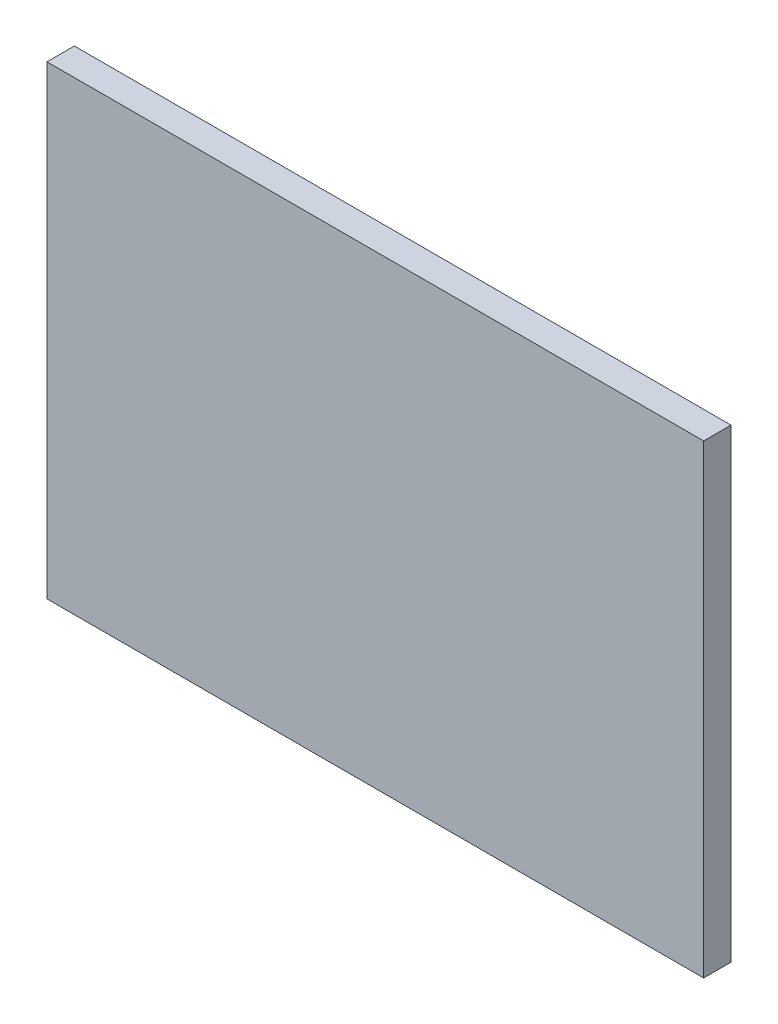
ISO-10303-21;
HEADER;
FILE_DESCRIPTION(('STEP AP214'),'2;1');
FILE_NAME('part.step','',(''),(''),'','','');
FILE_SCHEMA(('AUTOMOTIVE_DESIGN { 1 0 10303 214 1 1 1 1 }'));
ENDSEC;
DATA;
#1=APPLICATION_CONTEXT('core data for automotive mechanical design processes');
#2=APPLICATION_PROTOCOL_DEFINITION('international standard','automotive_design',2000,#1);
#3=PRODUCT_CONTEXT('',#1,'mechanical');
#4=PRODUCT('Part','Part','',(#3));
#5=PRODUCT_RELATED_PRODUCT_CATEGORY('part','',(#4));
#6=PRODUCT_DEFINITION_FORMATION('','',#4);
#7=PRODUCT_DEFINITION_CONTEXT('part definition',#1,'design');
#8=PRODUCT_DEFINITION('design','',#6,#7);
#9=PRODUCT_DEFINITION_SHAPE('','',#8);
#10=(LENGTH_UNIT() NAMED_UNIT(*) SI_UNIT(.MILLI.,.METRE.));
#11=(NAMED_UNIT(*) PLANE_ANGLE_UNIT() SI_UNIT($,.RADIAN.));
#12=(NAMED_UNIT(*) SI_UNIT($,.STERADIAN.) SOLID_ANGLE_UNIT());
#13=UNCERTAINTY_MEASURE_WITH_UNIT(LENGTH_MEASURE(1.E-05),#10,'distance_accuracy_value','');
#14=(GEOMETRIC_REPRESENTATION_CONTEXT(3) GLOBAL_UNCERTAINTY_ASSIGNED_CONTEXT((#13)) GLOBAL_UNIT_ASSIGNED_CONTEXT((#10,
#11,#12)) REPRESENTATION_CONTEXT('',''));
#15=CARTESIAN_POINT('',(0.,0.,0.));
#16=DIRECTION('',(0.,0.,1.));
#17=DIRECTION('',(1.,0.,0.));
#18=AXIS2_PLACEMENT_3D('',#15,#16,#17);
#19=CARTESIAN_POINT('',(-60.,-42.5,5.));
#20=DIRECTION('',(1.,0.,0.));
#21=DIRECTION('',(0.,0.,-1.));
#22=AXIS2_PLACEMENT_3D('',#19,#20,#21);
#23=PLANE('',#22);
#24=DIRECTION('',(0.,-1.,0.));
#25=VECTOR('',#24,1.);
#26=CARTESIAN_POINT('',(-60.,-42.5,0.));
#27=LINE('',#26,#25);
#28=CARTESIAN_POINT('',(-60.,42.5,0.));
#29=VERTEX_POINT('',#28);
#30=CARTESIAN_POINT('',(-60.,-42.5,0.));
#31=VERTEX_POINT('',#30);
#32=EDGE_CURVE('E104',#29,#31,#27,.T.);
#33=ORIENTED_EDGE('',*,*,#32,.T.);
#34=DIRECTION('',(0.,0.,-1.));
#35=VECTOR('',#34,1.);
#36=CARTESIAN_POINT('',(-60.,-42.5,5.));
#37=LINE('',#36,#35);
#38=CARTESIAN_POINT('',(-60.,-42.5,5.));
#39=VERTEX_POINT('',#38);
#40=EDGE_CURVE('E11',#39,#31,#37,.T.);
#41=ORIENTED_EDGE('',*,*,#40,.F.);
#42=DIRECTION('',(0.,-1.,0.));
#43=VECTOR('',#42,1.);
#44=CARTESIAN_POINT('',(-60.,-42.5,5.));
#45=LINE('',#44,#43);
#46=CARTESIAN_POINT('',(-60.,42.5,5.));
#47=VERTEX_POINT('',#46);
#48=EDGE_CURVE('E92',#47,#39,#45,.T.);
#49=ORIENTED_EDGE('',*,*,#48,.F.);
#50=DIRECTION('',(0.,0.,-1.));
#51=VECTOR('',#50,1.);
#52=CARTESIAN_POINT('',(-60.,42.5,5.));
#53=LINE('',#52,#51);
#54=EDGE_CURVE('E100',#47,#29,#53,.T.);
#55=ORIENTED_EDGE('',*,*,#54,.T.);
#56=EDGE_LOOP('',(#33,#41,#49,#55));
#57=FACE_BOUND('',#56,.T.);
#58=ADVANCED_FACE('F41',(#57),#23,.F.);
#59=CARTESIAN_POINT('',(60.,-42.5,5.));
#60=DIRECTION('',(0.,1.,0.));
#61=DIRECTION('',(-1.,0.,0.));
#62=AXIS2_PLACEMENT_3D('',#59,#60,#61);
#63=PLANE('',#62);
#64=DIRECTION('',(1.,0.,0.));
#65=VECTOR('',#64,1.);
#66=CARTESIAN_POINT('',(60.,-42.5,0.));
#67=LINE('',#66,#65);
#68=CARTESIAN_POINT('',(60.,-42.5,0.));
#69=VERTEX_POINT('',#68);
#70=EDGE_CURVE('E96',#31,#69,#67,.T.);
#71=ORIENTED_EDGE('',*,*,#70,.T.);
#72=DIRECTION('',(0.,0.,-1.));
#73=VECTOR('',#72,1.);
#74=CARTESIAN_POINT('',(60.,-42.5,5.));
#75=LINE('',#74,#73);
#76=CARTESIAN_POINT('',(60.,-42.5,5.));
#77=VERTEX_POINT('',#76);
#78=EDGE_CURVE('E49',#77,#69,#75,.T.);
#79=ORIENTED_EDGE('',*,*,#78,.F.);
#80=DIRECTION('',(1.,0.,0.));
#81=VECTOR('',#80,1.);
#82=CARTESIAN_POINT('',(60.,-42.5,5.));
#83=LINE('',#82,#81);
#84=EDGE_CURVE('E87',#39,#77,#83,.T.);
#85=ORIENTED_EDGE('',*,*,#84,.F.);
#86=ORIENTED_EDGE('',*,*,#40,.T.);
#87=EDGE_LOOP('',(#71,#79,#85,#86));
#88=FACE_BOUND('',#87,.T.);
#89=ADVANCED_FACE('F95',(#88),#63,.F.);
#90=CARTESIAN_POINT('',(60.,-42.5,5.));
#91=DIRECTION('',(-1.,0.,0.));
#92=DIRECTION('',(0.,0.,1.));
#93=AXIS2_PLACEMENT_3D('',#90,#91,#92);
#94=PLANE('',#93);
#95=DIRECTION('',(0.,1.,0.));
#96=VECTOR('',#95,1.);
#97=CARTESIAN_POINT('',(60.,-42.5,0.));
#98=LINE('',#97,#96);
#99=CARTESIAN_POINT('',(60.,42.5,0.));
#100=VERTEX_POINT('',#99);
#101=EDGE_CURVE('E74',#69,#100,#98,.T.);
#102=ORIENTED_EDGE('',*,*,#101,.T.);
#103=DIRECTION('',(0.,0.,-1.));
#104=VECTOR('',#103,1.);
#105=CARTESIAN_POINT('',(60.,42.5,5.));
#106=LINE('',#105,#104);
#107=CARTESIAN_POINT('',(60.,42.5,5.));
#108=VERTEX_POINT('',#107);
#109=EDGE_CURVE('E97',#108,#100,#106,.T.);
#110=ORIENTED_EDGE('',*,*,#109,.F.);
#111=DIRECTION('',(0.,1.,0.));
#112=VECTOR('',#111,1.);
#113=CARTESIAN_POINT('',(60.,-42.5,5.));
#114=LINE('',#113,#112);
#115=EDGE_CURVE('E90',#77,#108,#114,.T.);
#116=ORIENTED_EDGE('',*,*,#115,.F.);
#117=ORIENTED_EDGE('',*,*,#78,.T.);
#118=EDGE_LOOP('',(#102,#110,#116,#117));
#119=FACE_BOUND('',#118,.T.);
#120=ADVANCED_FACE('F98',(#119),#94,.F.);
#121=CARTESIAN_POINT('',(60.,42.5,5.));
#122=DIRECTION('',(0.,-1.,0.));
#123=DIRECTION('',(1.,0.,0.));
#124=AXIS2_PLACEMENT_3D('',#121,#122,#123);
#125=PLANE('',#124);
#126=DIRECTION('',(-1.,0.,0.));
#127=VECTOR('',#126,1.);
#128=CARTESIAN_POINT('',(60.,42.5,0.));
#129=LINE('',#128,#127);
#130=EDGE_CURVE('E80',#100,#29,#129,.T.);
#131=ORIENTED_EDGE('',*,*,#130,.T.);
#132=ORIENTED_EDGE('',*,*,#54,.F.);
#133=DIRECTION('',(-1.,0.,0.));
#134=VECTOR('',#133,1.);
#135=CARTESIAN_POINT('',(60.,42.5,5.));
#136=LINE('',#135,#134);
#137=EDGE_CURVE('E57',#108,#47,#136,.T.);
#138=ORIENTED_EDGE('',*,*,#137,.F.);
#139=ORIENTED_EDGE('',*,*,#109,.T.);
#140=EDGE_LOOP('',(#131,#132,#138,#139));
#141=FACE_BOUND('',#140,.T.);
#142=ADVANCED_FACE('F111',(#141),#125,.F.);
#143=CARTESIAN_POINT('',(0.,0.,5.));
#144=DIRECTION('',(0.,0.,1.));
#145=DIRECTION('',(1.,0.,0.));
#146=AXIS2_PLACEMENT_3D('',#143,#144,#145);
#147=PLANE('',#146);
#148=ORIENTED_EDGE('',*,*,#48,.T.);
#149=ORIENTED_EDGE('',*,*,#84,.T.);
#150=ORIENTED_EDGE('',*,*,#115,.T.);
#151=ORIENTED_EDGE('',*,*,#137,.T.);
#152=EDGE_LOOP('',(#148,#149,#150,#151));
#153=FACE_BOUND('',#152,.T.);
#154=ADVANCED_FACE('F88',(#153),#147,.T.);
#155=CARTESIAN_POINT('',(0.,0.,0.));
#156=DIRECTION('',(0.,0.,1.));
#157=DIRECTION('',(1.,0.,0.));
#158=AXIS2_PLACEMENT_3D('',#155,#156,#157);
#159=PLANE('',#158);
#160=ORIENTED_EDGE('',*,*,#32,.F.);
#161=ORIENTED_EDGE('',*,*,#130,.F.);
#162=ORIENTED_EDGE('',*,*,#101,.F.);
#163=ORIENTED_EDGE('',*,*,#70,.F.);
#164=EDGE_LOOP('',(#160,#161,#162,#163));
#165=FACE_BOUND('',#164,.T.);
#166=ADVANCED_FACE('F114',(#165),#159,.F.);
#167=CLOSED_SHELL('',(#58,#89,#120,#142,#154,#166));
#168=MANIFOLD_SOLID_BREP('B2',#167);
#169=ADVANCED_BREP_SHAPE_REPRESENTATION('',(#18,#168),#14);
#170=SHAPE_DEFINITION_REPRESENTATION(#9,#169);
ENDSEC;
END-ISO-10303-21;
